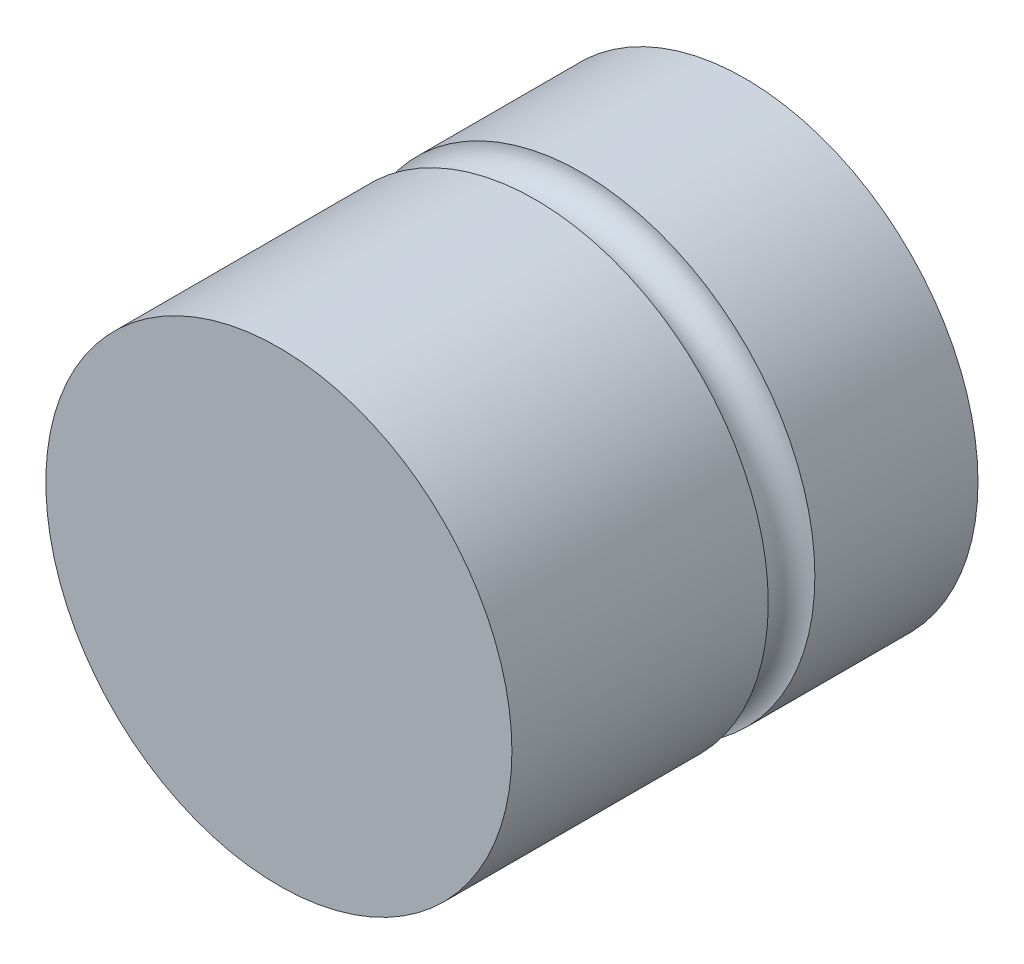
from build123d import *

# Parameters (mm, degrees)
SZKIC1_R                    = 50
DODANIE_WYCI_GNI_CIE1_DEPTH = 100


with BuildPart() as part:
    # Szkic1 → Dodanie-wyci_gni_cie1 (new body)
    with BuildSketch(Plane.XY):
        Circle(SZKIC1_R)
    extrude(amount=DODANIE_WYCI_GNI_CIE1_DEPTH)

    # Szkic2 → Wyci_cie-obr_t1 (revolve, cut)
    with BuildSketch(Plane(origin=(0, 0, 0), x_dir=(0, 0, -1), z_dir=(0.8722259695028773, 0.4891031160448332, 0)), mode=Mode.PRIVATE) as wyci_cie_obr_t1_sk:
        with BuildLine():
            Line((-35, 50), (-45, 50))
            ThreePointArc((-45, 50), (-40, 45), (-35, 50))
        make_face()
    revolve(wyci_cie_obr_t1_sk.sketch.rotate(Axis((0, 0, 91.964223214), (0, 0, -1)), 119.281649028), axis=Axis((0, 0, 91.964223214), (0, 0, -1)), mode=Mode.SUBTRACT)


solid = part.part
